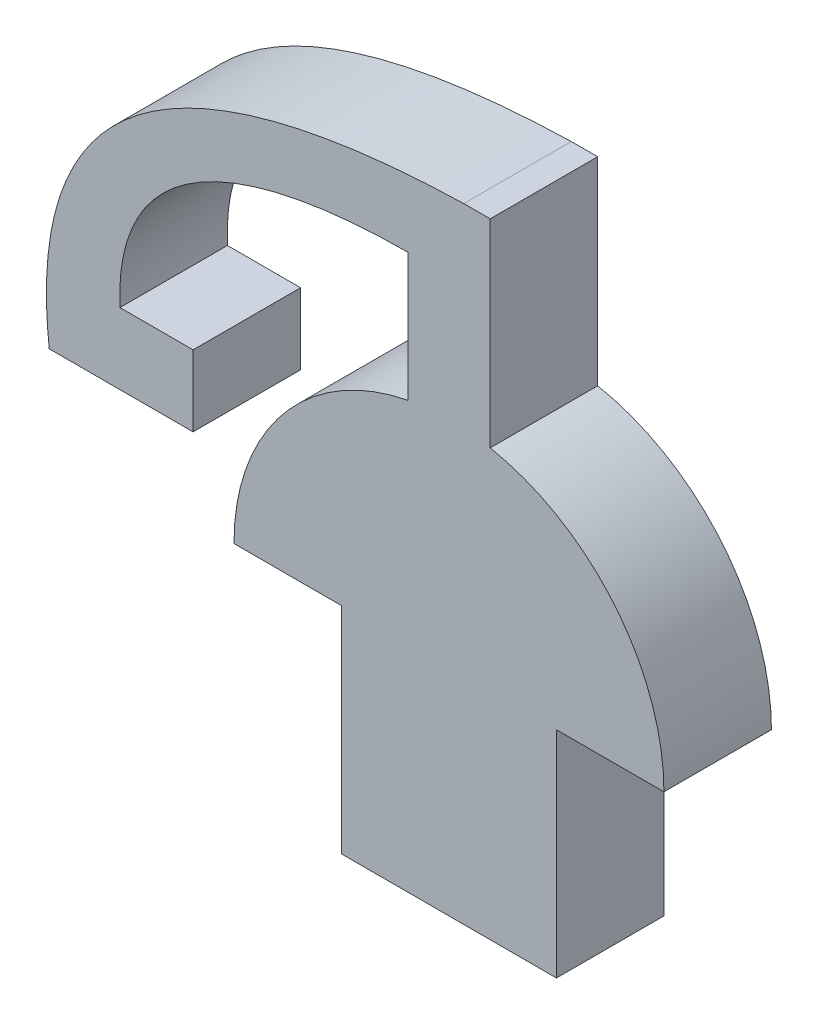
ISO-10303-21;
HEADER;
FILE_DESCRIPTION(('STEP AP214'),'2;1');
FILE_NAME('part.step','',(''),(''),'','','');
FILE_SCHEMA(('AUTOMOTIVE_DESIGN { 1 0 10303 214 1 1 1 1 }'));
ENDSEC;
DATA;
#1=APPLICATION_CONTEXT('core data for automotive mechanical design processes');
#2=APPLICATION_PROTOCOL_DEFINITION('international standard','automotive_design',2000,#1);
#3=PRODUCT_CONTEXT('',#1,'mechanical');
#4=PRODUCT('Part','Part','',(#3));
#5=PRODUCT_RELATED_PRODUCT_CATEGORY('part','',(#4));
#6=PRODUCT_DEFINITION_FORMATION('','',#4);
#7=PRODUCT_DEFINITION_CONTEXT('part definition',#1,'design');
#8=PRODUCT_DEFINITION('design','',#6,#7);
#9=PRODUCT_DEFINITION_SHAPE('','',#8);
#10=(LENGTH_UNIT() NAMED_UNIT(*) SI_UNIT(.MILLI.,.METRE.));
#11=(NAMED_UNIT(*) PLANE_ANGLE_UNIT() SI_UNIT($,.RADIAN.));
#12=(NAMED_UNIT(*) SI_UNIT($,.STERADIAN.) SOLID_ANGLE_UNIT());
#13=UNCERTAINTY_MEASURE_WITH_UNIT(LENGTH_MEASURE(1.E-05),#10,'distance_accuracy_value','');
#14=(GEOMETRIC_REPRESENTATION_CONTEXT(3) GLOBAL_UNCERTAINTY_ASSIGNED_CONTEXT((#13)) GLOBAL_UNIT_ASSIGNED_CONTEXT((#10,
#11,#12)) REPRESENTATION_CONTEXT('',''));
#15=CARTESIAN_POINT('',(0.,0.,0.));
#16=DIRECTION('',(0.,0.,1.));
#17=DIRECTION('',(1.,0.,0.));
#18=AXIS2_PLACEMENT_3D('',#15,#16,#17);
#19=CARTESIAN_POINT('',(0.,-6.35,3.175));
#20=DIRECTION('',(0.,1.,0.));
#21=DIRECTION('',(0.,0.,1.));
#22=AXIS2_PLACEMENT_3D('',#19,#20,#21);
#23=PLANE('',#22);
#24=DIRECTION('',(1.,0.,0.));
#25=VECTOR('',#24,1.);
#26=CARTESIAN_POINT('',(0.,-6.35,0.));
#27=LINE('',#26,#25);
#28=CARTESIAN_POINT('',(-3.175,-6.35,0.));
#29=VERTEX_POINT('',#28);
#30=CARTESIAN_POINT('',(3.175,-6.35,0.));
#31=VERTEX_POINT('',#30);
#32=EDGE_CURVE('E108',#29,#31,#27,.T.);
#33=ORIENTED_EDGE('',*,*,#32,.T.);
#34=DIRECTION('',(0.,0.,-1.));
#35=VECTOR('',#34,1.);
#36=CARTESIAN_POINT('',(3.175,-6.35,3.175));
#37=LINE('',#36,#35);
#38=CARTESIAN_POINT('',(3.175,-6.35,3.175));
#39=VERTEX_POINT('',#38);
#40=EDGE_CURVE('E11',#39,#31,#37,.T.);
#41=ORIENTED_EDGE('',*,*,#40,.F.);
#42=DIRECTION('',(1.,0.,0.));
#43=VECTOR('',#42,1.);
#44=CARTESIAN_POINT('',(0.,-6.35,3.175));
#45=LINE('',#44,#43);
#46=CARTESIAN_POINT('',(-3.175,-6.35,3.175));
#47=VERTEX_POINT('',#46);
#48=EDGE_CURVE('E114',#47,#39,#45,.T.);
#49=ORIENTED_EDGE('',*,*,#48,.F.);
#50=DIRECTION('',(0.,0.,-1.));
#51=VECTOR('',#50,1.);
#52=CARTESIAN_POINT('',(-3.175,-6.35,3.175));
#53=LINE('',#52,#51);
#54=EDGE_CURVE('E169',#47,#29,#53,.T.);
#55=ORIENTED_EDGE('',*,*,#54,.T.);
#56=EDGE_LOOP('',(#33,#41,#49,#55));
#57=FACE_BOUND('',#56,.T.);
#58=ADVANCED_FACE('F35',(#57),#23,.F.);
#59=CARTESIAN_POINT('',(3.175,0.,3.175));
#60=DIRECTION('',(-1.,0.,0.));
#61=DIRECTION('',(0.,0.,1.));
#62=AXIS2_PLACEMENT_3D('',#59,#60,#61);
#63=PLANE('',#62);
#64=DIRECTION('',(0.,1.,0.));
#65=VECTOR('',#64,1.);
#66=CARTESIAN_POINT('',(3.175,0.,0.));
#67=LINE('',#66,#65);
#68=CARTESIAN_POINT('',(3.175,0.,0.));
#69=VERTEX_POINT('',#68);
#70=EDGE_CURVE('E174',#31,#69,#67,.T.);
#71=ORIENTED_EDGE('',*,*,#70,.T.);
#72=DIRECTION('',(0.,0.,-1.));
#73=VECTOR('',#72,1.);
#74=CARTESIAN_POINT('',(3.175,0.,3.175));
#75=LINE('',#74,#73);
#76=CARTESIAN_POINT('',(3.175,0.,3.175));
#77=VERTEX_POINT('',#76);
#78=EDGE_CURVE('E43',#77,#69,#75,.T.);
#79=ORIENTED_EDGE('',*,*,#78,.F.);
#80=DIRECTION('',(0.,1.,0.));
#81=VECTOR('',#80,1.);
#82=CARTESIAN_POINT('',(3.175,0.,3.175));
#83=LINE('',#82,#81);
#84=EDGE_CURVE('E304',#39,#77,#83,.T.);
#85=ORIENTED_EDGE('',*,*,#84,.F.);
#86=ORIENTED_EDGE('',*,*,#40,.T.);
#87=EDGE_LOOP('',(#71,#79,#85,#86));
#88=FACE_BOUND('',#87,.T.);
#89=ADVANCED_FACE('F298',(#88),#63,.F.);
#90=CARTESIAN_POINT('',(6.35,0.,3.175));
#91=DIRECTION('',(0.,1.,0.));
#92=DIRECTION('',(0.,0.,1.));
#93=AXIS2_PLACEMENT_3D('',#90,#91,#92);
#94=PLANE('',#93);
#95=DIRECTION('',(1.,0.,0.));
#96=VECTOR('',#95,1.);
#97=CARTESIAN_POINT('',(6.35,0.,0.));
#98=LINE('',#97,#96);
#99=CARTESIAN_POINT('',(6.35,0.,0.));
#100=VERTEX_POINT('',#99);
#101=EDGE_CURVE('E176',#69,#100,#98,.T.);
#102=ORIENTED_EDGE('',*,*,#101,.T.);
#103=DIRECTION('',(0.,0.,-1.));
#104=VECTOR('',#103,1.);
#105=CARTESIAN_POINT('',(6.35,0.,3.175));
#106=LINE('',#105,#104);
#107=CARTESIAN_POINT('',(6.35,0.,3.175));
#108=VERTEX_POINT('',#107);
#109=EDGE_CURVE('E238',#108,#100,#106,.T.);
#110=ORIENTED_EDGE('',*,*,#109,.F.);
#111=DIRECTION('',(1.,0.,0.));
#112=VECTOR('',#111,1.);
#113=CARTESIAN_POINT('',(6.35,0.,3.175));
#114=LINE('',#113,#112);
#115=EDGE_CURVE('E247',#77,#108,#114,.T.);
#116=ORIENTED_EDGE('',*,*,#115,.F.);
#117=ORIENTED_EDGE('',*,*,#78,.T.);
#118=EDGE_LOOP('',(#102,#110,#116,#117));
#119=FACE_BOUND('',#118,.T.);
#120=ADVANCED_FACE('F245',(#119),#94,.F.);
#121=CARTESIAN_POINT('',(0.,0.,3.175));
#122=DIRECTION('',(0.,0.,-1.));
#123=DIRECTION('',(-1.,0.,0.));
#124=AXIS2_PLACEMENT_3D('',#121,#122,#123);
#125=CYLINDRICAL_SURFACE('',#124,6.35);
#126=CARTESIAN_POINT('',(0.,0.,0.));
#127=DIRECTION('',(0.,0.,1.));
#128=DIRECTION('',(1.,0.,0.));
#129=AXIS2_PLACEMENT_3D('',#126,#127,#128);
#130=CIRCLE('',#129,6.35);
#131=CARTESIAN_POINT('',(1.21809473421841,6.23207390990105,0.));
#132=VERTEX_POINT('',#131);
#133=EDGE_CURVE('E178',#100,#132,#130,.T.);
#134=ORIENTED_EDGE('',*,*,#133,.T.);
#135=DIRECTION('',(0.,0.,-1.));
#136=VECTOR('',#135,1.);
#137=CARTESIAN_POINT('',(1.21809473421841,6.23207390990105,3.175));
#138=LINE('',#137,#136);
#139=CARTESIAN_POINT('',(1.21809473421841,6.23207390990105,3.175));
#140=VERTEX_POINT('',#139);
#141=EDGE_CURVE('E235',#140,#132,#138,.T.);
#142=ORIENTED_EDGE('',*,*,#141,.F.);
#143=CARTESIAN_POINT('',(0.,0.,3.175));
#144=DIRECTION('',(0.,0.,1.));
#145=DIRECTION('',(1.,0.,0.));
#146=AXIS2_PLACEMENT_3D('',#143,#144,#145);
#147=CIRCLE('',#146,6.35);
#148=EDGE_CURVE('E265',#108,#140,#147,.T.);
#149=ORIENTED_EDGE('',*,*,#148,.F.);
#150=ORIENTED_EDGE('',*,*,#109,.T.);
#151=EDGE_LOOP('',(#134,#142,#149,#150));
#152=FACE_BOUND('',#151,.T.);
#153=ADVANCED_FACE('F256',(#152),#125,.T.);
#154=CARTESIAN_POINT('',(1.21809473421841,12.0905218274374,3.175));
#155=DIRECTION('',(-1.,0.,0.));
#156=DIRECTION('',(0.,-1.,0.));
#157=AXIS2_PLACEMENT_3D('',#154,#155,#156);
#158=PLANE('',#157);
#159=DIRECTION('',(0.,1.,0.));
#160=VECTOR('',#159,1.);
#161=CARTESIAN_POINT('',(1.21809473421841,12.0905218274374,0.));
#162=LINE('',#161,#160);
#163=CARTESIAN_POINT('',(1.21809473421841,12.0905218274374,0.));
#164=VERTEX_POINT('',#163);
#165=EDGE_CURVE('E180',#132,#164,#162,.T.);
#166=ORIENTED_EDGE('',*,*,#165,.T.);
#167=DIRECTION('',(0.,0.,-1.));
#168=VECTOR('',#167,1.);
#169=CARTESIAN_POINT('',(1.21809473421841,12.0905218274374,3.175));
#170=LINE('',#169,#168);
#171=CARTESIAN_POINT('',(1.21809473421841,12.0905218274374,3.175));
#172=VERTEX_POINT('',#171);
#173=EDGE_CURVE('E232',#172,#164,#170,.T.);
#174=ORIENTED_EDGE('',*,*,#173,.F.);
#175=DIRECTION('',(0.,1.,0.));
#176=VECTOR('',#175,1.);
#177=CARTESIAN_POINT('',(1.21809473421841,12.0905218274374,3.175));
#178=LINE('',#177,#176);
#179=EDGE_CURVE('E262',#140,#172,#178,.T.);
#180=ORIENTED_EDGE('',*,*,#179,.F.);
#181=ORIENTED_EDGE('',*,*,#141,.T.);
#182=EDGE_LOOP('',(#166,#174,#180,#181));
#183=FACE_BOUND('',#182,.T.);
#184=ADVANCED_FACE('F260',(#183),#158,.F.);
#185=CARTESIAN_POINT('',(0.437924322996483,12.0905218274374,3.175));
#186=DIRECTION('',(0.,-1.,0.));
#187=DIRECTION('',(0.,0.,-1.));
#188=AXIS2_PLACEMENT_3D('',#185,#186,#187);
#189=PLANE('',#188);
#190=DIRECTION('',(-1.,0.,0.));
#191=VECTOR('',#190,1.);
#192=CARTESIAN_POINT('',(0.437924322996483,12.0905218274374,0.));
#193=LINE('',#192,#191);
#194=CARTESIAN_POINT('',(0.437924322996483,12.0905218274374,0.));
#195=VERTEX_POINT('',#194);
#196=EDGE_CURVE('E182',#164,#195,#193,.T.);
#197=ORIENTED_EDGE('',*,*,#196,.T.);
#198=DIRECTION('',(0.,0.,-1.));
#199=VECTOR('',#198,1.);
#200=CARTESIAN_POINT('',(0.437924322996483,12.0905218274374,3.175));
#201=LINE('',#200,#199);
#202=CARTESIAN_POINT('',(0.437924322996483,12.0905218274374,3.175));
#203=VERTEX_POINT('',#202);
#204=EDGE_CURVE('E229',#203,#195,#201,.T.);
#205=ORIENTED_EDGE('',*,*,#204,.F.);
#206=DIRECTION('',(-1.,0.,0.));
#207=VECTOR('',#206,1.);
#208=CARTESIAN_POINT('',(0.437924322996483,12.0905218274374,3.175));
#209=LINE('',#208,#207);
#210=EDGE_CURVE('E264',#172,#203,#209,.T.);
#211=ORIENTED_EDGE('',*,*,#210,.F.);
#212=ORIENTED_EDGE('',*,*,#173,.T.);
#213=EDGE_LOOP('',(#197,#205,#211,#212));
#214=FACE_BOUND('',#213,.T.);
#215=ADVANCED_FACE('F287',(#214),#189,.F.);
#216=CARTESIAN_POINT('',(0.437924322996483,12.0905218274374,3.175));
#217=CARTESIAN_POINT('',(-12.9098002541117,11.7386809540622,3.175));
#218=CARTESIAN_POINT('',(-11.8053695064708,2.25252211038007,3.175));
#219=B_SPLINE_CURVE_WITH_KNOTS('',2,(#216,#217,#218),.UNSPECIFIED.,.F.,.F.,(3,3),(0.,1.),.UNSPECIFIED.);
#220=DIRECTION('',(0.,0.,-1.));
#221=VECTOR('',#220,1.);
#222=SURFACE_OF_LINEAR_EXTRUSION('',#219,#221);
#223=CARTESIAN_POINT('',(0.437924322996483,12.0905218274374,0.));
#224=CARTESIAN_POINT('',(-12.9098002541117,11.7386809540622,0.));
#225=CARTESIAN_POINT('',(-11.8053695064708,2.25252211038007,0.));
#226=B_SPLINE_CURVE_WITH_KNOTS('',2,(#223,#224,#225),.UNSPECIFIED.,.F.,.F.,(3,3),(0.,1.),.UNSPECIFIED.);
#227=CARTESIAN_POINT('',(-11.8053695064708,2.25252211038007,0.));
#228=VERTEX_POINT('',#227);
#229=EDGE_CURVE('E184',#195,#228,#226,.T.);
#230=ORIENTED_EDGE('',*,*,#229,.T.);
#231=DIRECTION('',(0.,0.,-1.));
#232=VECTOR('',#231,1.);
#233=CARTESIAN_POINT('',(-11.8053695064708,2.25252211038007,3.175));
#234=LINE('',#233,#232);
#235=CARTESIAN_POINT('',(-11.8053695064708,2.25252211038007,3.175));
#236=VERTEX_POINT('',#235);
#237=EDGE_CURVE('E226',#236,#228,#234,.T.);
#238=ORIENTED_EDGE('',*,*,#237,.F.);
#239=EDGE_CURVE('E267',#203,#236,#219,.T.);
#240=ORIENTED_EDGE('',*,*,#239,.F.);
#241=ORIENTED_EDGE('',*,*,#204,.T.);
#242=EDGE_LOOP('',(#230,#238,#240,#241));
#243=FACE_BOUND('',#242,.T.);
#244=ADVANCED_FACE('F282',(#243),#222,.F.);
#245=CARTESIAN_POINT('',(-11.8053695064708,2.25252211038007,3.175));
#246=DIRECTION('',(0.,1.,0.));
#247=DIRECTION('',(0.,0.,1.));
#248=AXIS2_PLACEMENT_3D('',#245,#246,#247);
#249=PLANE('',#248);
#250=DIRECTION('',(1.,0.,0.));
#251=VECTOR('',#250,1.);
#252=CARTESIAN_POINT('',(-11.8053695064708,2.25252211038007,0.));
#253=LINE('',#252,#251);
#254=CARTESIAN_POINT('',(-7.55702562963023,2.25252211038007,0.));
#255=VERTEX_POINT('',#254);
#256=EDGE_CURVE('E188',#228,#255,#253,.T.);
#257=ORIENTED_EDGE('',*,*,#256,.T.);
#258=DIRECTION('',(0.,0.,-1.));
#259=VECTOR('',#258,1.);
#260=CARTESIAN_POINT('',(-7.55702562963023,2.25252211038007,3.175));
#261=LINE('',#260,#259);
#262=CARTESIAN_POINT('',(-7.55702562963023,2.25252211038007,3.175));
#263=VERTEX_POINT('',#262);
#264=EDGE_CURVE('E223',#263,#255,#261,.T.);
#265=ORIENTED_EDGE('',*,*,#264,.F.);
#266=DIRECTION('',(1.,0.,0.));
#267=VECTOR('',#266,1.);
#268=CARTESIAN_POINT('',(-11.8053695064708,2.25252211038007,3.175));
#269=LINE('',#268,#267);
#270=EDGE_CURVE('E276',#236,#263,#269,.T.);
#271=ORIENTED_EDGE('',*,*,#270,.F.);
#272=ORIENTED_EDGE('',*,*,#237,.T.);
#273=EDGE_LOOP('',(#257,#265,#271,#272));
#274=FACE_BOUND('',#273,.T.);
#275=ADVANCED_FACE('F286',(#274),#249,.F.);
#276=CARTESIAN_POINT('',(-7.55702562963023,2.25252211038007,3.175));
#277=DIRECTION('',(-1.,0.,0.));
#278=DIRECTION('',(0.,0.,1.));
#279=AXIS2_PLACEMENT_3D('',#276,#277,#278);
#280=PLANE('',#279);
#281=DIRECTION('',(0.,1.,0.));
#282=VECTOR('',#281,1.);
#283=CARTESIAN_POINT('',(-7.55702562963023,2.25252211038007,0.));
#284=LINE('',#283,#282);
#285=CARTESIAN_POINT('',(-7.55702562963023,4.35238384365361,0.));
#286=VERTEX_POINT('',#285);
#287=EDGE_CURVE('E193',#255,#286,#284,.T.);
#288=ORIENTED_EDGE('',*,*,#287,.T.);
#289=DIRECTION('',(0.,0.,-1.));
#290=VECTOR('',#289,1.);
#291=CARTESIAN_POINT('',(-7.55702562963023,4.35238384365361,3.175));
#292=LINE('',#291,#290);
#293=CARTESIAN_POINT('',(-7.55702562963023,4.35238384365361,3.175));
#294=VERTEX_POINT('',#293);
#295=EDGE_CURVE('E220',#294,#286,#292,.T.);
#296=ORIENTED_EDGE('',*,*,#295,.F.);
#297=DIRECTION('',(0.,1.,0.));
#298=VECTOR('',#297,1.);
#299=CARTESIAN_POINT('',(-7.55702562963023,2.25252211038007,3.175));
#300=LINE('',#299,#298);
#301=EDGE_CURVE('E330',#263,#294,#300,.T.);
#302=ORIENTED_EDGE('',*,*,#301,.F.);
#303=ORIENTED_EDGE('',*,*,#264,.T.);
#304=EDGE_LOOP('',(#288,#296,#302,#303));
#305=FACE_BOUND('',#304,.T.);
#306=ADVANCED_FACE('F327',(#305),#280,.F.);
#307=CARTESIAN_POINT('',(-7.55702562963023,4.35238384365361,3.175));
#308=DIRECTION('',(0.,-1.,0.));
#309=DIRECTION('',(1.,0.,0.));
#310=AXIS2_PLACEMENT_3D('',#307,#308,#309);
#311=PLANE('',#310);
#312=DIRECTION('',(-1.,0.,0.));
#313=VECTOR('',#312,1.);
#314=CARTESIAN_POINT('',(-7.55702562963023,4.35238384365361,0.));
#315=LINE('',#314,#313);
#316=CARTESIAN_POINT('',(-9.71832555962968,4.35238384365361,0.));
#317=VERTEX_POINT('',#316);
#318=EDGE_CURVE('E195',#286,#317,#315,.T.);
#319=ORIENTED_EDGE('',*,*,#318,.T.);
#320=DIRECTION('',(0.,0.,-1.));
#321=VECTOR('',#320,1.);
#322=CARTESIAN_POINT('',(-9.71832555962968,4.35238384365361,3.175));
#323=LINE('',#322,#321);
#324=CARTESIAN_POINT('',(-9.71832555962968,4.35238384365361,3.175));
#325=VERTEX_POINT('',#324);
#326=EDGE_CURVE('E217',#325,#317,#323,.T.);
#327=ORIENTED_EDGE('',*,*,#326,.F.);
#328=DIRECTION('',(-1.,0.,0.));
#329=VECTOR('',#328,1.);
#330=CARTESIAN_POINT('',(-7.55702562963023,4.35238384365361,3.175));
#331=LINE('',#330,#329);
#332=EDGE_CURVE('E321',#294,#325,#331,.T.);
#333=ORIENTED_EDGE('',*,*,#332,.F.);
#334=ORIENTED_EDGE('',*,*,#295,.T.);
#335=EDGE_LOOP('',(#319,#327,#333,#334));
#336=FACE_BOUND('',#335,.T.);
#337=ADVANCED_FACE('F320',(#336),#311,.F.);
#338=CARTESIAN_POINT('',(-9.71832555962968,4.35238384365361,3.175));
#339=CARTESIAN_POINT('',(-9.92744832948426,9.2319151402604,3.175));
#340=CARTESIAN_POINT('',(-4.66054864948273,10.0073590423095,3.175));
#341=CARTESIAN_POINT('',(-1.21254471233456,10.0204833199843,3.175));
#342=B_SPLINE_CURVE_WITH_KNOTS('',3,(#338,#339,#340,#341),.UNSPECIFIED.,.F.,.F.,(4,4),(0.,
0.593316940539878),.UNSPECIFIED.);
#343=DIRECTION('',(0.,0.,-1.));
#344=VECTOR('',#343,1.);
#345=SURFACE_OF_LINEAR_EXTRUSION('',#342,#344);
#346=CARTESIAN_POINT('',(-9.71832555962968,4.35238384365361,0.));
#347=CARTESIAN_POINT('',(-9.92744832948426,9.2319151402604,0.));
#348=CARTESIAN_POINT('',(-4.66054864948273,10.0073590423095,0.));
#349=CARTESIAN_POINT('',(-1.21254471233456,10.0204833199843,0.));
#350=B_SPLINE_CURVE_WITH_KNOTS('',3,(#346,#347,#348,#349),.UNSPECIFIED.,.F.,.F.,(4,4),(0.,
0.593316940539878),.UNSPECIFIED.);
#351=CARTESIAN_POINT('',(-1.21254471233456,10.0204833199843,0.));
#352=VERTEX_POINT('',#351);
#353=EDGE_CURVE('E197',#317,#352,#350,.T.);
#354=ORIENTED_EDGE('',*,*,#353,.T.);
#355=DIRECTION('',(0.,0.,-1.));
#356=VECTOR('',#355,1.);
#357=CARTESIAN_POINT('',(-1.21254471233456,10.0204833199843,3.175));
#358=LINE('',#357,#356);
#359=CARTESIAN_POINT('',(-1.21254471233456,10.0204833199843,3.175));
#360=VERTEX_POINT('',#359);
#361=EDGE_CURVE('E214',#360,#352,#358,.T.);
#362=ORIENTED_EDGE('',*,*,#361,.F.);
#363=EDGE_CURVE('E316',#325,#360,#342,.T.);
#364=ORIENTED_EDGE('',*,*,#363,.F.);
#365=ORIENTED_EDGE('',*,*,#326,.T.);
#366=EDGE_LOOP('',(#354,#362,#364,#365));
#367=FACE_BOUND('',#366,.T.);
#368=ADVANCED_FACE('F315',(#367),#345,.F.);
#369=CARTESIAN_POINT('',(-1.21254471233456,10.0204833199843,3.175));
#370=DIRECTION('',(1.,0.,0.));
#371=DIRECTION('',(0.,1.,0.));
#372=AXIS2_PLACEMENT_3D('',#369,#370,#371);
#373=PLANE('',#372);
#374=DIRECTION('',(0.,-1.,0.));
#375=VECTOR('',#374,1.);
#376=CARTESIAN_POINT('',(-1.21254471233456,10.0204833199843,0.));
#377=LINE('',#376,#375);
#378=CARTESIAN_POINT('',(-1.21254471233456,6.23315612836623,0.));
#379=VERTEX_POINT('',#378);
#380=EDGE_CURVE('E201',#352,#379,#377,.T.);
#381=ORIENTED_EDGE('',*,*,#380,.T.);
#382=DIRECTION('',(0.,0.,-1.));
#383=VECTOR('',#382,1.);
#384=CARTESIAN_POINT('',(-1.21254471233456,6.23315612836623,3.175));
#385=LINE('',#384,#383);
#386=CARTESIAN_POINT('',(-1.21254471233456,6.23315612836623,3.175));
#387=VERTEX_POINT('',#386);
#388=EDGE_CURVE('E164',#387,#379,#385,.T.);
#389=ORIENTED_EDGE('',*,*,#388,.F.);
#390=DIRECTION('',(0.,-1.,0.));
#391=VECTOR('',#390,1.);
#392=CARTESIAN_POINT('',(-1.21254471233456,10.0204833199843,3.175));
#393=LINE('',#392,#391);
#394=EDGE_CURVE('E155',#360,#387,#393,.T.);
#395=ORIENTED_EDGE('',*,*,#394,.F.);
#396=ORIENTED_EDGE('',*,*,#361,.T.);
#397=EDGE_LOOP('',(#381,#389,#395,#396));
#398=FACE_BOUND('',#397,.T.);
#399=ADVANCED_FACE('F311',(#398),#373,.F.);
#400=CARTESIAN_POINT('',(0.,0.,3.175));
#401=DIRECTION('',(0.,0.,-1.));
#402=DIRECTION('',(-1.,0.,0.));
#403=AXIS2_PLACEMENT_3D('',#400,#401,#402);
#404=CYLINDRICAL_SURFACE('',#403,6.35);
#405=CARTESIAN_POINT('',(0.,0.,0.));
#406=DIRECTION('',(0.,0.,1.));
#407=DIRECTION('',(1.,0.,0.));
#408=AXIS2_PLACEMENT_3D('',#405,#406,#407);
#409=CIRCLE('',#408,6.35);
#410=CARTESIAN_POINT('',(-6.35,0.,0.));
#411=VERTEX_POINT('',#410);
#412=EDGE_CURVE('E163',#379,#411,#409,.T.);
#413=ORIENTED_EDGE('',*,*,#412,.T.);
#414=DIRECTION('',(0.,0.,-1.));
#415=VECTOR('',#414,1.);
#416=CARTESIAN_POINT('',(-6.35,0.,3.175));
#417=LINE('',#416,#415);
#418=CARTESIAN_POINT('',(-6.35,0.,3.175));
#419=VERTEX_POINT('',#418);
#420=EDGE_CURVE('E160',#419,#411,#417,.T.);
#421=ORIENTED_EDGE('',*,*,#420,.F.);
#422=CARTESIAN_POINT('',(0.,0.,3.175));
#423=DIRECTION('',(0.,0.,1.));
#424=DIRECTION('',(1.,0.,0.));
#425=AXIS2_PLACEMENT_3D('',#422,#423,#424);
#426=CIRCLE('',#425,6.35);
#427=EDGE_CURVE('E149',#387,#419,#426,.T.);
#428=ORIENTED_EDGE('',*,*,#427,.F.);
#429=ORIENTED_EDGE('',*,*,#388,.T.);
#430=EDGE_LOOP('',(#413,#421,#428,#429));
#431=FACE_BOUND('',#430,.T.);
#432=ADVANCED_FACE('F161',(#431),#404,.T.);
#433=CARTESIAN_POINT('',(-6.35,0.,3.175));
#434=DIRECTION('',(0.,1.,0.));
#435=DIRECTION('',(-1.,0.,0.));
#436=AXIS2_PLACEMENT_3D('',#433,#434,#435);
#437=PLANE('',#436);
#438=DIRECTION('',(1.,0.,0.));
#439=VECTOR('',#438,1.);
#440=CARTESIAN_POINT('',(-6.35,0.,0.));
#441=LINE('',#440,#439);
#442=CARTESIAN_POINT('',(-3.175,0.,0.));
#443=VERTEX_POINT('',#442);
#444=EDGE_CURVE('E101',#411,#443,#441,.T.);
#445=ORIENTED_EDGE('',*,*,#444,.T.);
#446=DIRECTION('',(0.,0.,-1.));
#447=VECTOR('',#446,1.);
#448=CARTESIAN_POINT('',(-3.175,0.,3.175));
#449=LINE('',#448,#447);
#450=CARTESIAN_POINT('',(-3.175,0.,3.175));
#451=VERTEX_POINT('',#450);
#452=EDGE_CURVE('E165',#451,#443,#449,.T.);
#453=ORIENTED_EDGE('',*,*,#452,.F.);
#454=DIRECTION('',(1.,0.,0.));
#455=VECTOR('',#454,1.);
#456=CARTESIAN_POINT('',(-6.35,0.,3.175));
#457=LINE('',#456,#455);
#458=EDGE_CURVE('E153',#419,#451,#457,.T.);
#459=ORIENTED_EDGE('',*,*,#458,.F.);
#460=ORIENTED_EDGE('',*,*,#420,.T.);
#461=EDGE_LOOP('',(#445,#453,#459,#460));
#462=FACE_BOUND('',#461,.T.);
#463=ADVANCED_FACE('F167',(#462),#437,.F.);
#464=CARTESIAN_POINT('',(-3.175,-6.35,3.175));
#465=DIRECTION('',(1.,0.,0.));
#466=DIRECTION('',(0.,0.,-1.));
#467=AXIS2_PLACEMENT_3D('',#464,#465,#466);
#468=PLANE('',#467);
#469=DIRECTION('',(0.,-1.,0.));
#470=VECTOR('',#469,1.);
#471=CARTESIAN_POINT('',(-3.175,-6.35,0.));
#472=LINE('',#471,#470);
#473=EDGE_CURVE('E208',#443,#29,#472,.T.);
#474=ORIENTED_EDGE('',*,*,#473,.T.);
#475=ORIENTED_EDGE('',*,*,#54,.F.);
#476=DIRECTION('',(0.,-1.,0.));
#477=VECTOR('',#476,1.);
#478=CARTESIAN_POINT('',(-3.175,-6.35,3.175));
#479=LINE('',#478,#477);
#480=EDGE_CURVE('E51',#451,#47,#479,.T.);
#481=ORIENTED_EDGE('',*,*,#480,.F.);
#482=ORIENTED_EDGE('',*,*,#452,.T.);
#483=EDGE_LOOP('',(#474,#475,#481,#482));
#484=FACE_BOUND('',#483,.T.);
#485=ADVANCED_FACE('F306',(#484),#468,.F.);
#486=CARTESIAN_POINT('',(0.,0.,3.175));
#487=DIRECTION('',(0.,0.,1.));
#488=DIRECTION('',(1.,0.,0.));
#489=AXIS2_PLACEMENT_3D('',#486,#487,#488);
#490=PLANE('',#489);
#491=ORIENTED_EDGE('',*,*,#48,.T.);
#492=ORIENTED_EDGE('',*,*,#84,.T.);
#493=ORIENTED_EDGE('',*,*,#115,.T.);
#494=ORIENTED_EDGE('',*,*,#148,.T.);
#495=ORIENTED_EDGE('',*,*,#179,.T.);
#496=ORIENTED_EDGE('',*,*,#210,.T.);
#497=ORIENTED_EDGE('',*,*,#239,.T.);
#498=ORIENTED_EDGE('',*,*,#270,.T.);
#499=ORIENTED_EDGE('',*,*,#301,.T.);
#500=ORIENTED_EDGE('',*,*,#332,.T.);
#501=ORIENTED_EDGE('',*,*,#363,.T.);
#502=ORIENTED_EDGE('',*,*,#394,.T.);
#503=ORIENTED_EDGE('',*,*,#427,.T.);
#504=ORIENTED_EDGE('',*,*,#458,.T.);
#505=ORIENTED_EDGE('',*,*,#480,.T.);
#506=EDGE_LOOP('',(#491,#492,#493,#494,#495,#496,#497,#498,#499,#500,#501,#502,#503,#504,#505));
#507=FACE_BOUND('',#506,.T.);
#508=ADVANCED_FACE('F151',(#507),#490,.T.);
#509=CARTESIAN_POINT('',(0.,0.,0.));
#510=DIRECTION('',(0.,0.,1.));
#511=DIRECTION('',(1.,0.,0.));
#512=AXIS2_PLACEMENT_3D('',#509,#510,#511);
#513=PLANE('',#512);
#514=ORIENTED_EDGE('',*,*,#32,.F.);
#515=ORIENTED_EDGE('',*,*,#473,.F.);
#516=ORIENTED_EDGE('',*,*,#444,.F.);
#517=ORIENTED_EDGE('',*,*,#412,.F.);
#518=ORIENTED_EDGE('',*,*,#380,.F.);
#519=ORIENTED_EDGE('',*,*,#353,.F.);
#520=ORIENTED_EDGE('',*,*,#318,.F.);
#521=ORIENTED_EDGE('',*,*,#287,.F.);
#522=ORIENTED_EDGE('',*,*,#256,.F.);
#523=ORIENTED_EDGE('',*,*,#229,.F.);
#524=ORIENTED_EDGE('',*,*,#196,.F.);
#525=ORIENTED_EDGE('',*,*,#165,.F.);
#526=ORIENTED_EDGE('',*,*,#133,.F.);
#527=ORIENTED_EDGE('',*,*,#101,.F.);
#528=ORIENTED_EDGE('',*,*,#70,.F.);
#529=EDGE_LOOP('',(#514,#515,#516,#517,#518,#519,#520,#521,#522,#523,#524,#525,#526,#527,#528));
#530=FACE_BOUND('',#529,.T.);
#531=ADVANCED_FACE('F251',(#530),#513,.F.);
#532=CLOSED_SHELL('',(#58,#89,#120,#153,#184,#215,#244,#275,#306,#337,#368,#399,#432,#463,#485,
#508,#531));
#533=MANIFOLD_SOLID_BREP('B2',#532);
#534=ADVANCED_BREP_SHAPE_REPRESENTATION('',(#18,#533),#14);
#535=SHAPE_DEFINITION_REPRESENTATION(#9,#534);
ENDSEC;
END-ISO-10303-21;
